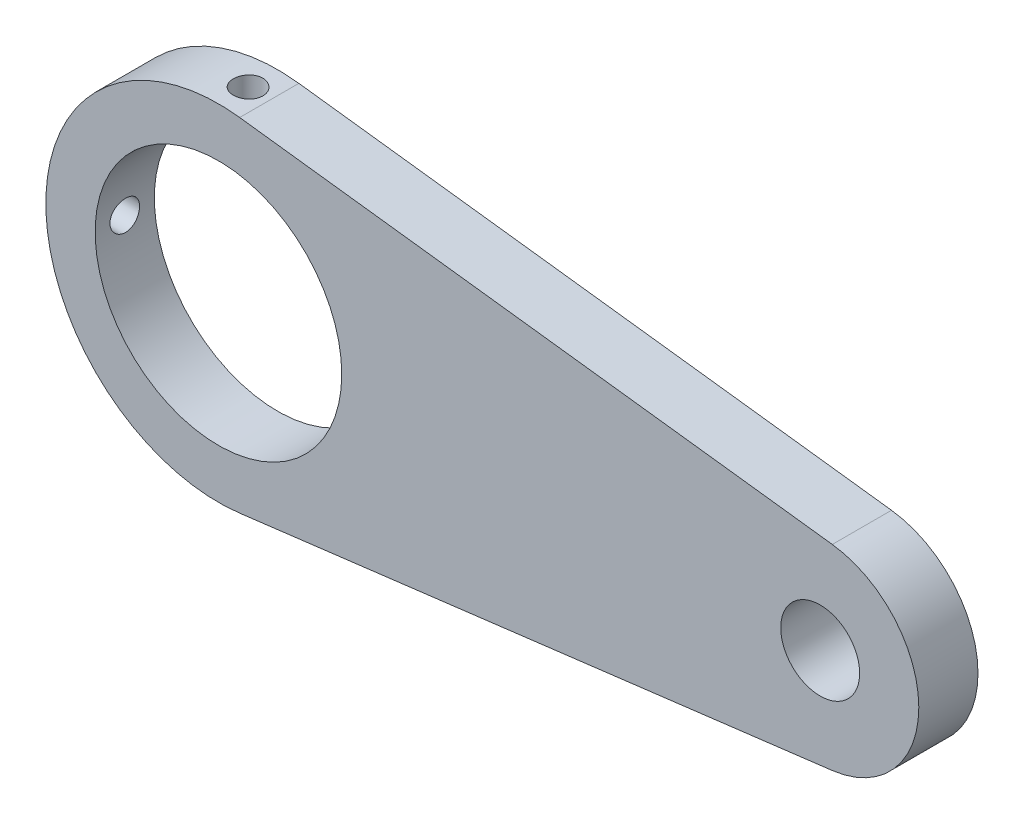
from build123d import *

# Parameters (mm, degrees)
SKETCH_1_R          = 25
SKETCH_1_R_2        = 8
EXTRUDE_1_DEPTH     = 12
SKETCH_2_R          = 3
CUT_EXTRUDE_1_DEPTH = 12
SKETCH_3_R          = 3
CUT_EXTRUDE_2_DEPTH = 17


with BuildPart() as part:
    # Sketch 1 → Extrude 1 (new body)
    with BuildSketch(Plane.XY):
        with BuildLine():
            Line((4.303278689, 34.734446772), (124.459016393, 19.848255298))
            ThreePointArc((124.459016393, 19.848255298), (142, 0), (124.459016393, -19.848255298))
            Line((124.459016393, -19.848255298), (4.303278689, -34.734446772))
            ThreePointArc((4.303278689, -34.734446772), (-35, 0), (4.303278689, 34.734446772))
        make_face()
        Circle(SKETCH_1_R, mode=Mode.SUBTRACT)
        with Locations((122, 0)):
            Circle(SKETCH_1_R_2, mode=Mode.SUBTRACT)
    extrude(amount=EXTRUDE_1_DEPTH)

    # Sketch 2 → Cut-Extrude 1 (cut)
    with BuildSketch(Plane(origin=(0, 35, 0), x_dir=(1, 0, 0), z_dir=(0, 1, 0))):
        with Locations(Location((0, -6, 0), (0, 0, 270))):
            Circle(SKETCH_2_R)
    extrude(amount=-CUT_EXTRUDE_1_DEPTH, mode=Mode.SUBTRACT)

    # Sketch 3 → Cut-Extrude 2 (cut)
    with BuildSketch(Plane(origin=(-35, 0, 0), x_dir=(0, 0, -1), z_dir=(1, 0, 0))):
        with Locations(Location((-6, 0, 0), (0, 0, 180))):
            Circle(SKETCH_3_R)
    extrude(amount=CUT_EXTRUDE_2_DEPTH, mode=Mode.SUBTRACT)


solid = part.part
